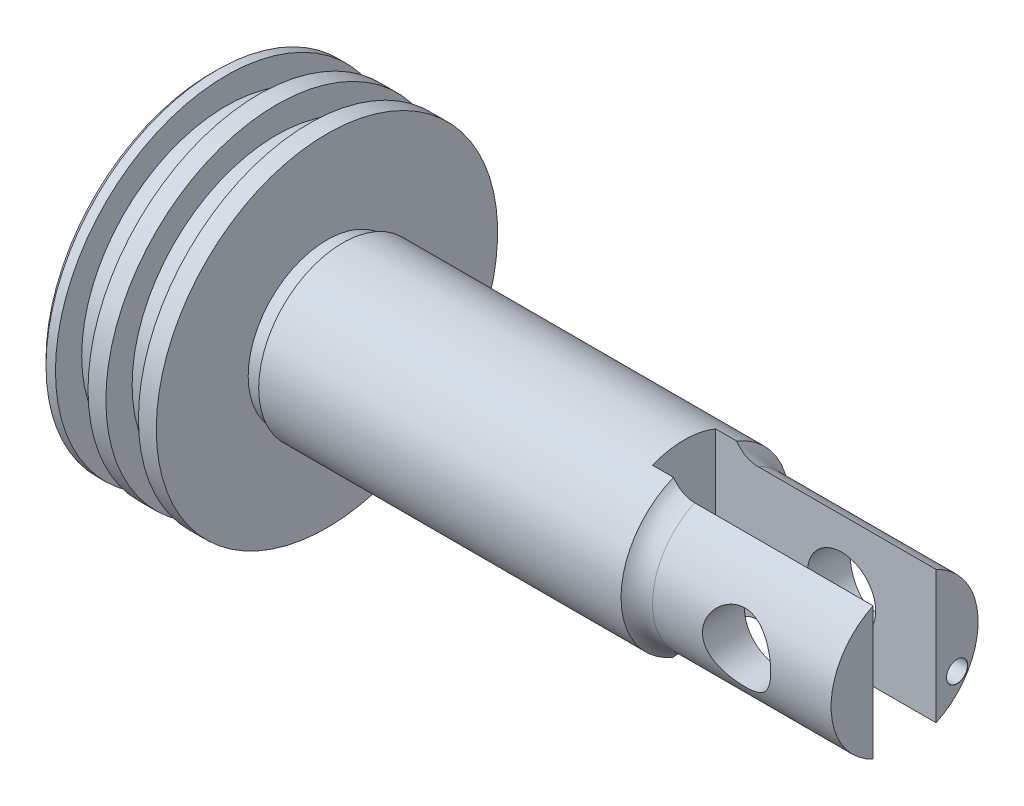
from build123d import *

# Parameters (mm, degrees)
SKETCH_1_W            = 6.2
SKETCH_1_H            = 27.5
SKETCH_1_W_2          = 3
SKETCH_1_H_2          = 15
SKETCH_2_R            = 6.5
CUT_EXTRUDE_1_DEPTH   = 55.5
SKETCH_3_W            = 12
SKETCH_3_H            = 40.742028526
CUT_EXTRUDE_2_DEPTH   = 42
F_4_0MM_1_D           = 4
F_4_0MM_1_DEPTH       = 14
F_4_0MM_1_CSINK_D     = 4.05
F_4_0MM_1_CSINK_ANGLE = 90
F_4_0MM_1_TIP         = 1.201721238
CHAMFER_1_SIZE        = 1


with BuildPart() as part:
    # Sketch 1 → Revolve 2 (revolve)
    with BuildSketch(Plane.XY, mode=Mode.PRIVATE) as revolve_2_sk:
        Polygon((0, 32.5), (0, 0), (2.8, 0), (2.8, 27.5), (2.8, 32.5), align=None)
        with Locations((5.9, 13.75)):
            Rectangle(SKETCH_1_W, SKETCH_1_H)
        Polygon((9, 27.5), (9, 0), (12.4, 0), (12.4, 27.5), (12.4, 32.5), (9, 32.5), align=None)
        with Locations((15.5, 13.75)):
            Rectangle(SKETCH_1_W, SKETCH_1_H)
        Polygon((18.6, 27.5), (18.6, 0), (22, 0), (22, 15), (22, 32.5), (18.6, 32.5), align=None)
        with Locations((23.5, 7.5)):
            Rectangle(SKETCH_1_W_2, SKETCH_1_H_2)
        with BuildLine():
            Line((25, 15), (25, 0))
            Line((25, 0), (94, 0))
            Line((94, 0), (132, 0))
            Line((132, 0), (132, 14))
            Line((132, 14), (98, 14))
            ThreePointArc((98, 14), (95.763932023, 14.527864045), (94, 16))
            Line((94, 16), (25, 16))
            Line((25, 16), (25, 15))
        make_face()
    revolve(revolve_2_sk.sketch.rotate(Axis((12.4, 0, 0), (1, 0, 0)), 90), axis=Axis((12.4, 0, 0), (1, 0, 0)))

    # Sketch 2 → Cut-Extrude 1 (cut, symmetric)
    with BuildSketch(Plane.XY):
        with Locations((114, 0)):
            Circle(SKETCH_2_R)
    extrude(amount=CUT_EXTRUDE_1_DEPTH, both=True, mode=Mode.SUBTRACT)

    # Sketch 3 → Cut-Extrude 2 (cut)
    with BuildSketch(Plane(origin=(132, 0, 0), x_dir=(0, 0, -1), z_dir=(1, 0, 0))):
        Rectangle(SKETCH_3_W, SKETCH_3_H)
    extrude(amount=-CUT_EXTRUDE_2_DEPTH, mode=Mode.SUBTRACT)

    # 4.0mm _1
    with Locations(Plane(origin=(132, 0, 0), x_dir=(0, 0, -1), z_dir=(1, 0, 0))):
        with Locations((10, -6.179006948)):
            CounterSinkHole(F_4_0MM_1_D / 2, F_4_0MM_1_CSINK_D / 2, depth=F_4_0MM_1_DEPTH, counter_sink_angle=F_4_0MM_1_CSINK_ANGLE)
            with Locations((0, 0, -(F_4_0MM_1_DEPTH + F_4_0MM_1_TIP / 2))):  # 118° drill point
                Cone(0, F_4_0MM_1_D / 2, F_4_0MM_1_TIP, mode=Mode.SUBTRACT)

    # Chamfer 1
    chamfer_1_edges = [part.edges().sort_by_distance(p)[0] for p in [
        (0, 0, -32.5),
    ]]
    chamfer(chamfer_1_edges, length=CHAMFER_1_SIZE)


solid = part.part
